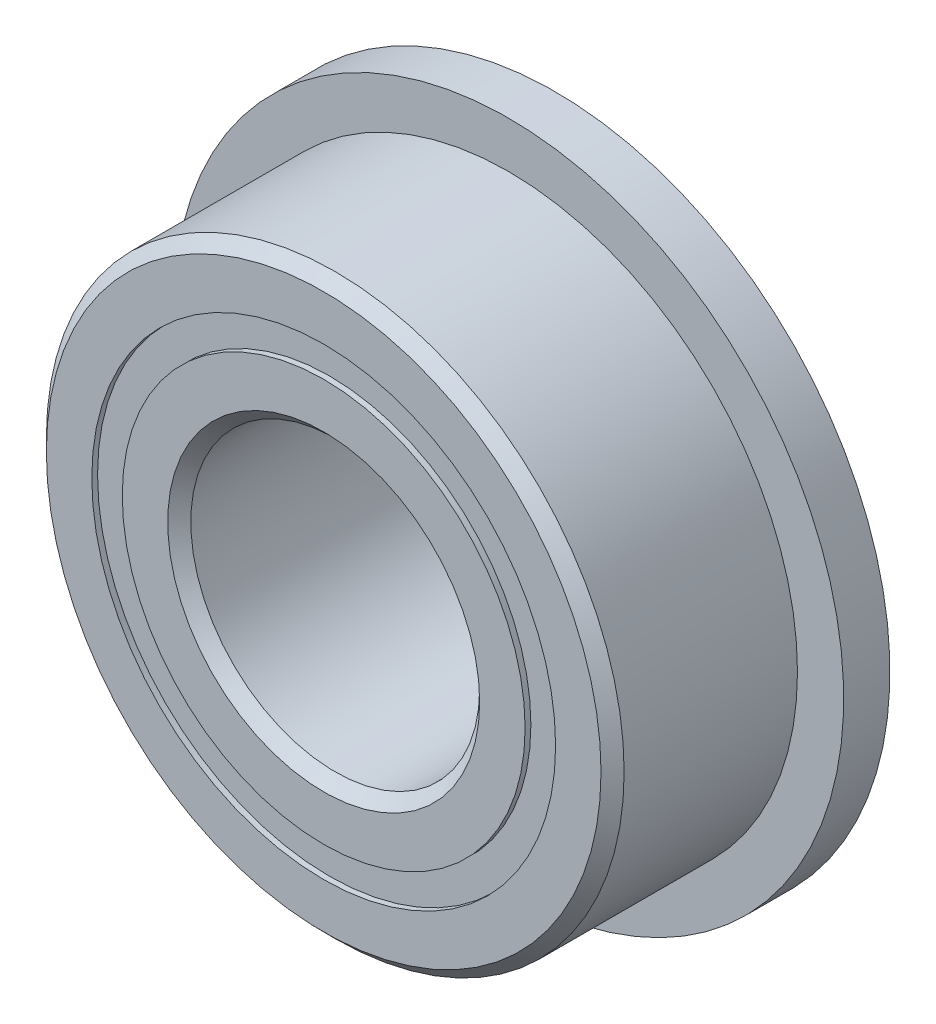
ISO-10303-21;
HEADER;
FILE_DESCRIPTION(('STEP AP214'),'2;1');
FILE_NAME('part.step','',(''),(''),'','','');
FILE_SCHEMA(('AUTOMOTIVE_DESIGN { 1 0 10303 214 1 1 1 1 }'));
ENDSEC;
DATA;
#1=APPLICATION_CONTEXT('core data for automotive mechanical design processes');
#2=APPLICATION_PROTOCOL_DEFINITION('international standard','automotive_design',2000,#1);
#3=PRODUCT_CONTEXT('',#1,'mechanical');
#4=PRODUCT('Part','Part','',(#3));
#5=PRODUCT_RELATED_PRODUCT_CATEGORY('part','',(#4));
#6=PRODUCT_DEFINITION_FORMATION('','',#4);
#7=PRODUCT_DEFINITION_CONTEXT('part definition',#1,'design');
#8=PRODUCT_DEFINITION('design','',#6,#7);
#9=PRODUCT_DEFINITION_SHAPE('','',#8);
#10=(LENGTH_UNIT() NAMED_UNIT(*) SI_UNIT(.MILLI.,.METRE.));
#11=(NAMED_UNIT(*) PLANE_ANGLE_UNIT() SI_UNIT($,.RADIAN.));
#12=(NAMED_UNIT(*) SI_UNIT($,.STERADIAN.) SOLID_ANGLE_UNIT());
#13=UNCERTAINTY_MEASURE_WITH_UNIT(LENGTH_MEASURE(1.E-05),#10,'distance_accuracy_value','');
#14=(GEOMETRIC_REPRESENTATION_CONTEXT(3) GLOBAL_UNCERTAINTY_ASSIGNED_CONTEXT((#13)) GLOBAL_UNIT_ASSIGNED_CONTEXT((#10,
#11,#12)) REPRESENTATION_CONTEXT('',''));
#15=CARTESIAN_POINT('',(0.,0.,0.));
#16=DIRECTION('',(0.,0.,1.));
#17=DIRECTION('',(1.,0.,0.));
#18=AXIS2_PLACEMENT_3D('',#15,#16,#17);
#19=CARTESIAN_POINT('',(1.87499999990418,3.24759526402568,0.));
#20=DIRECTION('',(0.866025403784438,-0.500000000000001,1.4901161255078E-08));
#21=DIRECTION('',(1.29047911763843E-08,-7.45056822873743E-09,-1.));
#22=AXIS2_PLACEMENT_3D('',#19,#20,#21);
#23=CIRCLE('',#22,0.927189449);
#24=TRIMMED_CURVE('',#23,(PARAMETER_VALUE(0.)),(PARAMETER_VALUE(3.14159262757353)),.T.,.PARAMETER.);
#25=CARTESIAN_POINT('',(1.875,3.247595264,0.));
#26=DIRECTION('',(0.,0.,1.));
#27=AXIS1_PLACEMENT('',#25,#26);
#28=SURFACE_OF_REVOLUTION('',#24,#27);
#29=CARTESIAN_POINT('',(1.875,3.247595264,-0.927189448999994));
#30=VERTEX_POINT('',#29);
#31=VERTEX_LOOP('',#30);
#32=FACE_BOUND('',#31,.T.);
#33=CARTESIAN_POINT('',(1.875,3.247595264,0.927189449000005));
#34=VERTEX_POINT('',#33);
#35=VERTEX_LOOP('',#34);
#36=FACE_BOUND('',#35,.T.);
#37=ADVANCED_FACE('P0_F15',(#32,#36),#28,.T.);
#38=CLOSED_SHELL('',(#37));
#39=MANIFOLD_SOLID_BREP('P0_B1',#38);
#40=CARTESIAN_POINT('',(0.,3.75,0.));
#41=DIRECTION('',(0.,0.,1.));
#42=DIRECTION('',(0.,-1.,0.));
#43=AXIS2_PLACEMENT_3D('',#40,#41,#42);
#44=SPHERICAL_SURFACE('',#43,0.927189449);
#45=CARTESIAN_POINT('',(0.,3.75,-0.927189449));
#46=VERTEX_POINT('',#45);
#47=VERTEX_LOOP('',#46);
#48=FACE_BOUND('',#47,.T.);
#49=CARTESIAN_POINT('',(0.,3.75,0.927189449));
#50=VERTEX_POINT('',#49);
#51=VERTEX_LOOP('',#50);
#52=FACE_BOUND('',#51,.T.);
#53=ADVANCED_FACE('P1_F15',(#48,#52),#44,.T.);
#54=CLOSED_SHELL('',(#53));
#55=MANIFOLD_SOLID_BREP('P1_B1',#54);
#56=CARTESIAN_POINT('',(-3.576322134,0.,-0.910777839));
#57=CARTESIAN_POINT('',(-3.576322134,-7.152644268,-0.910777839));
#58=CARTESIAN_POINT('',(3.576322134,-7.152644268,-0.910777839));
#59=CARTESIAN_POINT('',(3.576322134,0.,-0.910777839));
#60=CARTESIAN_POINT('',(-3.079483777,0.,-0.816034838));
#61=CARTESIAN_POINT('',(-3.079483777,-6.158967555,-0.816034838));
#62=CARTESIAN_POINT('',(3.079483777,-6.158967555,-0.816034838));
#63=CARTESIAN_POINT('',(3.079483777,0.,-0.816034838));
#64=CARTESIAN_POINT('',(-2.776947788,0.,-0.410699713));
#65=CARTESIAN_POINT('',(-2.776947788,-5.553895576,-0.410699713));
#66=CARTESIAN_POINT('',(2.776947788,-5.553895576,-0.410699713));
#67=CARTESIAN_POINT('',(2.776947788,0.,-0.410699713));
#68=CARTESIAN_POINT('',(-2.827442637,0.,0.092564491));
#69=CARTESIAN_POINT('',(-2.827442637,-5.654885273,0.0925644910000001));
#70=CARTESIAN_POINT('',(2.827442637,-5.654885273,0.0925644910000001));
#71=CARTESIAN_POINT('',(2.827442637,0.,0.092564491));
#72=(BOUNDED_SURFACE() B_SPLINE_SURFACE(3,3,((#56,#57,#58,#59),(#60,#61,#62,#63),(#64,#65,#66,
#67),(#68,#69,#70,#71)),.UNSPECIFIED.,.F.,.F.,.F.) B_SPLINE_SURFACE_WITH_KNOTS((4,4),(4,4),(0.,
1.),(0.,1.),.UNSPECIFIED.) GEOMETRIC_REPRESENTATION_ITEM() RATIONAL_B_SPLINE_SURFACE(((1.,
0.333333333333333,0.333333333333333,1.),(0.825113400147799,0.275037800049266,0.275037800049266,
0.825113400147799),(0.825113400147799,0.275037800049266,0.275037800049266,0.825113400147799),
(1.,0.333333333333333,0.333333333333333,1.))) REPRESENTATION_ITEM('') SURFACE());
#73=CARTESIAN_POINT('',(-3.576322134,0.,-0.910777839));
#74=CARTESIAN_POINT('',(-3.079483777,0.,-0.816034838));
#75=CARTESIAN_POINT('',(-2.776947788,0.,-0.410699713));
#76=CARTESIAN_POINT('',(-2.827442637,0.,0.092564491));
#77=(BOUNDED_CURVE() B_SPLINE_CURVE(3,(#73,#74,#75,#76),.UNSPECIFIED.,.F.,
.F.) B_SPLINE_CURVE_WITH_KNOTS((4,4),(0.,1.),
.UNSPECIFIED.) CURVE() GEOMETRIC_REPRESENTATION_ITEM() RATIONAL_B_SPLINE_CURVE((1.,
0.825113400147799,0.825113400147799,1.)) REPRESENTATION_ITEM(''));
#78=CARTESIAN_POINT('',(-3.4862637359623,-1.07256696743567E-09,-0.888888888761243));
#79=VERTEX_POINT('',#78);
#80=CARTESIAN_POINT('',(-2.82281055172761,0.,-9.19291736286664E-12));
#81=VERTEX_POINT('',#80);
#82=EDGE_CURVE('P2_E58',#79,#81,#77,.T.);
#83=CARTESIAN_POINT('',(0.,0.,-0.888888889));
#84=DIRECTION('',(0.,0.,1.));
#85=DIRECTION('',(1.,0.,0.));
#86=AXIS2_PLACEMENT_3D('',#83,#84,#85);
#87=CIRCLE('',#86,3.486263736);
#88=CARTESIAN_POINT('',(3.4862637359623,-3.13044270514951E-10,-0.888888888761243));
#89=VERTEX_POINT('',#88);
#90=EDGE_CURVE('P2_E63',#79,#89,#87,.T.);
#91=CARTESIAN_POINT('',(3.576322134,0.,-0.910777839));
#92=CARTESIAN_POINT('',(3.079483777,0.,-0.816034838));
#93=CARTESIAN_POINT('',(2.776947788,0.,-0.410699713));
#94=CARTESIAN_POINT('',(2.827442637,0.,0.092564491));
#95=(BOUNDED_CURVE() B_SPLINE_CURVE(3,(#91,#92,#93,#94),.UNSPECIFIED.,.F.,
.F.) B_SPLINE_CURVE_WITH_KNOTS((4,4),(0.,1.),
.UNSPECIFIED.) CURVE() GEOMETRIC_REPRESENTATION_ITEM() RATIONAL_B_SPLINE_CURVE((1.,
0.825113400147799,0.825113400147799,1.)) REPRESENTATION_ITEM(''));
#96=CARTESIAN_POINT('',(2.82281055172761,0.,-9.19292350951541E-12));
#97=VERTEX_POINT('',#96);
#98=EDGE_CURVE('P2_E50',#97,#89,#95,.F.);
#99=CARTESIAN_POINT('',(0.,0.,-1.8385876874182E-11));
#100=DIRECTION('',(0.,0.,-1.));
#101=DIRECTION('',(0.,1.,0.));
#102=AXIS2_PLACEMENT_3D('',#99,#100,#101);
#103=CIRCLE('',#102,2.82281055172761);
#104=EDGE_CURVE('P2_E71',#97,#81,#103,.T.);
#105=ORIENTED_EDGE('',*,*,#82,.F.);
#106=ORIENTED_EDGE('',*,*,#90,.T.);
#107=ORIENTED_EDGE('',*,*,#98,.F.);
#108=ORIENTED_EDGE('',*,*,#104,.T.);
#109=EDGE_LOOP('',(#105,#106,#107,#108));
#110=FACE_BOUND('',#109,.T.);
#111=ADVANCED_FACE('P2_F16',(#110),#72,.F.);
#112=CARTESIAN_POINT('',(-2.827442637,0.,-0.092564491));
#113=CARTESIAN_POINT('',(-2.827442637,-5.654885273,-0.0925644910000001));
#114=CARTESIAN_POINT('',(2.827442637,-5.654885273,-0.0925644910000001));
#115=CARTESIAN_POINT('',(2.827442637,0.,-0.092564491));
#116=CARTESIAN_POINT('',(-2.776947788,0.,0.410699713));
#117=CARTESIAN_POINT('',(-2.776947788,-5.553895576,0.410699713));
#118=CARTESIAN_POINT('',(2.776947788,-5.553895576,0.410699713));
#119=CARTESIAN_POINT('',(2.776947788,0.,0.410699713));
#120=CARTESIAN_POINT('',(-3.079483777,0.,0.816034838));
#121=CARTESIAN_POINT('',(-3.079483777,-6.158967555,0.816034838));
#122=CARTESIAN_POINT('',(3.079483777,-6.158967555,0.816034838));
#123=CARTESIAN_POINT('',(3.079483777,0.,0.816034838));
#124=CARTESIAN_POINT('',(-3.576322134,0.,0.910777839));
#125=CARTESIAN_POINT('',(-3.576322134,-7.152644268,0.910777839));
#126=CARTESIAN_POINT('',(3.576322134,-7.152644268,0.910777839));
#127=CARTESIAN_POINT('',(3.576322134,0.,0.910777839));
#128=(BOUNDED_SURFACE() B_SPLINE_SURFACE(3,3,((#112,#113,#114,#115),(#116,#117,#118,#119),(#120,
#121,#122,#123),(#124,#125,#126,#127)),.UNSPECIFIED.,.F.,.F.,
.F.) B_SPLINE_SURFACE_WITH_KNOTS((4,4),(4,4),(0.,1.),(0.,1.),
.UNSPECIFIED.) GEOMETRIC_REPRESENTATION_ITEM() RATIONAL_B_SPLINE_SURFACE(((1.,0.333333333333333,
0.333333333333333,1.),(0.825113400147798,0.275037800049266,0.275037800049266,0.825113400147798),
(0.825113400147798,0.275037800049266,0.275037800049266,0.825113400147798),(1.,0.333333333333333,
0.333333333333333,1.))) REPRESENTATION_ITEM('') SURFACE());
#129=CARTESIAN_POINT('',(2.827442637,0.,-0.092564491));
#130=CARTESIAN_POINT('',(2.776947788,0.,0.410699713));
#131=CARTESIAN_POINT('',(3.079483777,0.,0.816034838));
#132=CARTESIAN_POINT('',(3.576322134,0.,0.910777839));
#133=(BOUNDED_CURVE() B_SPLINE_CURVE(3,(#129,#130,#131,#132),.UNSPECIFIED.,.F.,
.F.) B_SPLINE_CURVE_WITH_KNOTS((4,4),(0.,1.),
.UNSPECIFIED.) CURVE() GEOMETRIC_REPRESENTATION_ITEM() RATIONAL_B_SPLINE_CURVE((1.,
0.825113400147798,0.825113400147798,1.)) REPRESENTATION_ITEM(''));
#134=CARTESIAN_POINT('',(3.48626373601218,-3.13044270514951E-10,0.888888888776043));
#135=VERTEX_POINT('',#134);
#136=EDGE_CURVE('P2_E76',#135,#97,#133,.F.);
#137=CARTESIAN_POINT('',(0.,0.,0.888888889));
#138=DIRECTION('',(0.,0.,1.));
#139=DIRECTION('',(1.,0.,0.));
#140=AXIS2_PLACEMENT_3D('',#137,#138,#139);
#141=CIRCLE('',#140,3.486263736);
#142=CARTESIAN_POINT('',(-3.4862637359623,-1.07256696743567E-09,0.888888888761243));
#143=VERTEX_POINT('',#142);
#144=EDGE_CURVE('P2_E69',#135,#143,#141,.F.);
#145=CARTESIAN_POINT('',(-2.827442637,0.,-0.092564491));
#146=CARTESIAN_POINT('',(-2.776947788,0.,0.410699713));
#147=CARTESIAN_POINT('',(-3.079483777,0.,0.816034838));
#148=CARTESIAN_POINT('',(-3.576322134,0.,0.910777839));
#149=(BOUNDED_CURVE() B_SPLINE_CURVE(3,(#145,#146,#147,#148),.UNSPECIFIED.,.F.,
.F.) B_SPLINE_CURVE_WITH_KNOTS((4,4),(0.,1.),
.UNSPECIFIED.) CURVE() GEOMETRIC_REPRESENTATION_ITEM() RATIONAL_B_SPLINE_CURVE((1.,
0.825113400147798,0.825113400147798,1.)) REPRESENTATION_ITEM(''));
#150=EDGE_CURVE('P2_E35',#81,#143,#149,.T.);
#151=ORIENTED_EDGE('',*,*,#104,.F.);
#152=ORIENTED_EDGE('',*,*,#136,.F.);
#153=ORIENTED_EDGE('',*,*,#144,.T.);
#154=ORIENTED_EDGE('',*,*,#150,.F.);
#155=EDGE_LOOP('',(#151,#152,#153,#154));
#156=FACE_BOUND('',#155,.T.);
#157=ADVANCED_FACE('P2_F121',(#156),#128,.F.);
#158=CARTESIAN_POINT('',(0.,0.,-1.8));
#159=DIRECTION('',(0.,0.,1.));
#160=DIRECTION('',(1.,0.,0.));
#161=AXIS2_PLACEMENT_3D('',#158,#159,#160);
#162=CYLINDRICAL_SURFACE('',#161,2.5);
#163=CARTESIAN_POINT('',(0.,0.,-1.79999999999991));
#164=DIRECTION('',(0.,0.,-1.));
#165=DIRECTION('',(-1.,0.,0.));
#166=AXIS2_PLACEMENT_3D('',#163,#164,#165);
#167=CIRCLE('',#166,2.5);
#168=CARTESIAN_POINT('',(-2.5,0.,-1.8));
#169=VERTEX_POINT('',#168);
#170=EDGE_CURVE('P2_E66',#169,#169,#167,.F.);
#171=ORIENTED_EDGE('',*,*,#170,.F.);
#172=EDGE_LOOP('',(#171));
#173=FACE_BOUND('',#172,.T.);
#174=CARTESIAN_POINT('',(0.,0.,1.80000000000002));
#175=DIRECTION('',(0.,0.,1.));
#176=DIRECTION('',(1.,0.,0.));
#177=AXIS2_PLACEMENT_3D('',#174,#175,#176);
#178=CIRCLE('',#177,2.5);
#179=CARTESIAN_POINT('',(2.5,0.,1.8));
#180=VERTEX_POINT('',#179);
#181=EDGE_CURVE('P2_E96',#180,#180,#178,.F.);
#182=ORIENTED_EDGE('',*,*,#181,.F.);
#183=EDGE_LOOP('',(#182));
#184=FACE_BOUND('',#183,.T.);
#185=ADVANCED_FACE('P2_F167',(#173,#184),#162,.F.);
#186=CARTESIAN_POINT('',(0.,0.,-1.8));
#187=DIRECTION('',(0.,0.,-1.));
#188=DIRECTION('',(-1.,0.,0.));
#189=AXIS2_PLACEMENT_3D('',#186,#187,#188);
#190=CONICAL_SURFACE('',#189,2.5,0.785398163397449);
#191=CARTESIAN_POINT('',(0.,0.,-1.99999999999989));
#192=DIRECTION('',(0.,0.,-1.));
#193=DIRECTION('',(-1.,0.,0.));
#194=AXIS2_PLACEMENT_3D('',#191,#192,#193);
#195=CIRCLE('',#194,2.69999999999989);
#196=CARTESIAN_POINT('',(-2.69999999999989,0.,-1.99999999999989));
#197=VERTEX_POINT('',#196);
#198=EDGE_CURVE('P2_E20',#197,#197,#195,.T.);
#199=ORIENTED_EDGE('',*,*,#198,.T.);
#200=EDGE_LOOP('',(#199));
#201=FACE_BOUND('',#200,.T.);
#202=ORIENTED_EDGE('',*,*,#170,.T.);
#203=EDGE_LOOP('',(#202));
#204=FACE_BOUND('',#203,.T.);
#205=ADVANCED_FACE('P2_F164',(#201,#204),#190,.F.);
#206=CARTESIAN_POINT('',(0.,0.,1.8));
#207=DIRECTION('',(0.,0.,1.));
#208=DIRECTION('',(1.,0.,0.));
#209=AXIS2_PLACEMENT_3D('',#206,#207,#208);
#210=CONICAL_SURFACE('',#209,2.5,0.785398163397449);
#211=ORIENTED_EDGE('',*,*,#181,.T.);
#212=EDGE_LOOP('',(#211));
#213=FACE_BOUND('',#212,.T.);
#214=CARTESIAN_POINT('',(0.,0.,2.));
#215=DIRECTION('',(0.,0.,1.));
#216=DIRECTION('',(1.,0.,0.));
#217=AXIS2_PLACEMENT_3D('',#214,#215,#216);
#218=CIRCLE('',#217,2.7);
#219=CARTESIAN_POINT('',(2.7,0.,2.));
#220=VERTEX_POINT('',#219);
#221=EDGE_CURVE('P2_E91',#220,#220,#218,.T.);
#222=ORIENTED_EDGE('',*,*,#221,.T.);
#223=EDGE_LOOP('',(#222));
#224=FACE_BOUND('',#223,.T.);
#225=ADVANCED_FACE('P2_F139',(#213,#224),#210,.F.);
#226=CARTESIAN_POINT('',(-3.528098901,-3.528098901,-2.));
#227=DIRECTION('',(0.,0.,1.));
#228=DIRECTION('',(1.,0.,0.));
#229=AXIS2_PLACEMENT_3D('',#226,#227,#228);
#230=PLANE('',#229);
#231=ORIENTED_EDGE('',*,*,#198,.F.);
#232=EDGE_LOOP('',(#231));
#233=FACE_BOUND('',#232,.T.);
#234=CARTESIAN_POINT('',(0.,0.,-2.));
#235=DIRECTION('',(0.,0.,1.));
#236=DIRECTION('',(1.,0.,0.));
#237=AXIS2_PLACEMENT_3D('',#234,#235,#236);
#238=CIRCLE('',#237,3.486263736);
#239=CARTESIAN_POINT('',(3.486263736,0.,-2.));
#240=VERTEX_POINT('',#239);
#241=EDGE_CURVE('P2_E89',#240,#240,#238,.F.);
#242=ORIENTED_EDGE('',*,*,#241,.T.);
#243=EDGE_LOOP('',(#242));
#244=FACE_BOUND('',#243,.T.);
#245=ADVANCED_FACE('P2_F130',(#233,#244),#230,.F.);
#246=CARTESIAN_POINT('',(3.528098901,-3.528098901,2.));
#247=DIRECTION('',(0.,0.,-1.));
#248=DIRECTION('',(-1.,0.,0.));
#249=AXIS2_PLACEMENT_3D('',#246,#247,#248);
#250=PLANE('',#249);
#251=ORIENTED_EDGE('',*,*,#221,.F.);
#252=EDGE_LOOP('',(#251));
#253=FACE_BOUND('',#252,.T.);
#254=CARTESIAN_POINT('',(0.,0.,2.));
#255=DIRECTION('',(0.,0.,1.));
#256=DIRECTION('',(0.,-1.,0.));
#257=AXIS2_PLACEMENT_3D('',#254,#255,#256);
#258=CIRCLE('',#257,3.486263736);
#259=CARTESIAN_POINT('',(0.,-3.486263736,2.));
#260=VERTEX_POINT('',#259);
#261=EDGE_CURVE('P2_E64',#260,#260,#258,.T.);
#262=ORIENTED_EDGE('',*,*,#261,.T.);
#263=EDGE_LOOP('',(#262));
#264=FACE_BOUND('',#263,.T.);
#265=ADVANCED_FACE('P2_F18',(#253,#264),#250,.F.);
#266=CARTESIAN_POINT('',(0.,0.,-2.));
#267=DIRECTION('',(0.,0.,1.));
#268=DIRECTION('',(1.,0.,0.));
#269=AXIS2_PLACEMENT_3D('',#266,#267,#268);
#270=CYLINDRICAL_SURFACE('',#269,3.486263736);
#271=ORIENTED_EDGE('',*,*,#241,.F.);
#272=EDGE_LOOP('',(#271));
#273=FACE_BOUND('',#272,.T.);
#274=CARTESIAN_POINT('',(0.,0.,-0.888888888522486));
#275=DIRECTION('',(0.,0.,-1.));
#276=DIRECTION('',(0.,1.,0.));
#277=AXIS2_PLACEMENT_3D('',#274,#275,#276);
#278=CIRCLE('',#277,3.48626373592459);
#279=EDGE_CURVE('P2_E53',#79,#89,#278,.T.);
#280=ORIENTED_EDGE('',*,*,#279,.T.);
#281=ORIENTED_EDGE('',*,*,#90,.F.);
#282=EDGE_LOOP('',(#280,#281));
#283=FACE_BOUND('',#282,.T.);
#284=ADVANCED_FACE('P2_F62',(#273,#283),#270,.T.);
#285=CARTESIAN_POINT('',(0.,0.,0.888888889));
#286=DIRECTION('',(0.,0.,1.));
#287=DIRECTION('',(0.,-1.,0.));
#288=AXIS2_PLACEMENT_3D('',#285,#286,#287);
#289=CYLINDRICAL_SURFACE('',#288,3.486263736);
#290=ORIENTED_EDGE('',*,*,#144,.F.);
#291=CARTESIAN_POINT('',(0.,0.,0.888888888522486));
#292=DIRECTION('',(0.,0.,1.));
#293=DIRECTION('',(0.,-1.,0.));
#294=AXIS2_PLACEMENT_3D('',#291,#292,#293);
#295=CIRCLE('',#294,3.48626373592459);
#296=EDGE_CURVE('P2_E26',#135,#143,#295,.T.);
#297=ORIENTED_EDGE('',*,*,#296,.T.);
#298=EDGE_LOOP('',(#290,#297));
#299=FACE_BOUND('',#298,.T.);
#300=ORIENTED_EDGE('',*,*,#261,.F.);
#301=EDGE_LOOP('',(#300));
#302=FACE_BOUND('',#301,.T.);
#303=ADVANCED_FACE('P2_F123',(#299,#302),#289,.T.);
#304=CARTESIAN_POINT('',(3.576322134,0.,-0.910777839));
#305=CARTESIAN_POINT('',(3.576322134,7.152644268,-0.910777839));
#306=CARTESIAN_POINT('',(-3.576322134,7.152644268,-0.910777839));
#307=CARTESIAN_POINT('',(-3.576322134,0.,-0.910777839));
#308=CARTESIAN_POINT('',(3.079483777,0.,-0.816034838));
#309=CARTESIAN_POINT('',(3.079483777,6.158967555,-0.816034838));
#310=CARTESIAN_POINT('',(-3.079483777,6.158967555,-0.816034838));
#311=CARTESIAN_POINT('',(-3.079483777,0.,-0.816034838));
#312=CARTESIAN_POINT('',(2.776947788,0.,-0.410699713));
#313=CARTESIAN_POINT('',(2.776947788,5.553895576,-0.410699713));
#314=CARTESIAN_POINT('',(-2.776947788,5.553895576,-0.410699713));
#315=CARTESIAN_POINT('',(-2.776947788,0.,-0.410699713));
#316=CARTESIAN_POINT('',(2.827442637,0.,0.092564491));
#317=CARTESIAN_POINT('',(2.827442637,5.654885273,0.0925644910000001));
#318=CARTESIAN_POINT('',(-2.827442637,5.654885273,0.0925644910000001));
#319=CARTESIAN_POINT('',(-2.827442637,0.,0.092564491));
#320=(BOUNDED_SURFACE() B_SPLINE_SURFACE(3,3,((#304,#305,#306,#307),(#308,#309,#310,#311),(#312,
#313,#314,#315),(#316,#317,#318,#319)),.UNSPECIFIED.,.F.,.F.,
.F.) B_SPLINE_SURFACE_WITH_KNOTS((4,4),(4,4),(0.,1.),(0.,1.),
.UNSPECIFIED.) GEOMETRIC_REPRESENTATION_ITEM() RATIONAL_B_SPLINE_SURFACE(((1.,0.333333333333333,
0.333333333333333,1.),(0.825113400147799,0.275037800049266,0.275037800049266,0.825113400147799),
(0.825113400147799,0.275037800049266,0.275037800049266,0.825113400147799),(1.,0.333333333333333,
0.333333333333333,1.))) REPRESENTATION_ITEM('') SURFACE());
#321=CARTESIAN_POINT('',(0.,0.,-1.8385876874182E-11));
#322=DIRECTION('',(0.,0.,-1.));
#323=DIRECTION('',(0.,1.,0.));
#324=AXIS2_PLACEMENT_3D('',#321,#322,#323);
#325=CIRCLE('',#324,2.82281055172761);
#326=EDGE_CURVE('P2_E11',#81,#97,#325,.T.);
#327=ORIENTED_EDGE('',*,*,#98,.T.);
#328=ORIENTED_EDGE('',*,*,#279,.F.);
#329=ORIENTED_EDGE('',*,*,#82,.T.);
#330=ORIENTED_EDGE('',*,*,#326,.T.);
#331=EDGE_LOOP('',(#327,#328,#329,#330));
#332=FACE_BOUND('',#331,.T.);
#333=ADVANCED_FACE('P2_F52',(#332),#320,.F.);
#334=CARTESIAN_POINT('',(2.827442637,0.,-0.092564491));
#335=CARTESIAN_POINT('',(2.827442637,5.654885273,-0.0925644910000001));
#336=CARTESIAN_POINT('',(-2.827442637,5.654885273,-0.0925644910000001));
#337=CARTESIAN_POINT('',(-2.827442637,0.,-0.092564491));
#338=CARTESIAN_POINT('',(2.776947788,0.,0.410699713));
#339=CARTESIAN_POINT('',(2.776947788,5.553895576,0.410699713));
#340=CARTESIAN_POINT('',(-2.776947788,5.553895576,0.410699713));
#341=CARTESIAN_POINT('',(-2.776947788,0.,0.410699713));
#342=CARTESIAN_POINT('',(3.079483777,0.,0.816034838));
#343=CARTESIAN_POINT('',(3.079483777,6.158967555,0.816034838));
#344=CARTESIAN_POINT('',(-3.079483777,6.158967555,0.816034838));
#345=CARTESIAN_POINT('',(-3.079483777,0.,0.816034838));
#346=CARTESIAN_POINT('',(3.576322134,0.,0.910777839));
#347=CARTESIAN_POINT('',(3.576322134,7.152644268,0.910777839));
#348=CARTESIAN_POINT('',(-3.576322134,7.152644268,0.910777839));
#349=CARTESIAN_POINT('',(-3.576322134,0.,0.910777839));
#350=(BOUNDED_SURFACE() B_SPLINE_SURFACE(3,3,((#334,#335,#336,#337),(#338,#339,#340,#341),(#342,
#343,#344,#345),(#346,#347,#348,#349)),.UNSPECIFIED.,.F.,.F.,
.F.) B_SPLINE_SURFACE_WITH_KNOTS((4,4),(4,4),(0.,1.),(0.,1.),
.UNSPECIFIED.) GEOMETRIC_REPRESENTATION_ITEM() RATIONAL_B_SPLINE_SURFACE(((1.,0.333333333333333,
0.333333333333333,1.),(0.825113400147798,0.275037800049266,0.275037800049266,0.825113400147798),
(0.825113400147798,0.275037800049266,0.275037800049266,0.825113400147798),(1.,0.333333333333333,
0.333333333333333,1.))) REPRESENTATION_ITEM('') SURFACE());
#351=ORIENTED_EDGE('',*,*,#326,.F.);
#352=ORIENTED_EDGE('',*,*,#150,.T.);
#353=ORIENTED_EDGE('',*,*,#296,.F.);
#354=ORIENTED_EDGE('',*,*,#136,.T.);
#355=EDGE_LOOP('',(#351,#352,#353,#354));
#356=FACE_BOUND('',#355,.T.);
#357=ADVANCED_FACE('P2_F118',(#356),#350,.F.);
#358=CLOSED_SHELL('',(#111,#157,#185,#205,#225,#245,#265,#284,#303,#333,#357));
#359=MANIFOLD_SOLID_BREP('P2_B1',#358);
#360=CARTESIAN_POINT('',(0.,0.,0.888888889));
#361=DIRECTION('',(0.,0.,1.));
#362=DIRECTION('',(0.,-1.,0.));
#363=AXIS2_PLACEMENT_3D('',#360,#361,#362);
#364=CYLINDRICAL_SURFACE('',#363,4.013736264);
#365=CARTESIAN_POINT('',(0.,0.,0.888888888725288));
#366=DIRECTION('',(0.,0.,-1.));
#367=DIRECTION('',(0.,1.,0.));
#368=AXIS2_PLACEMENT_3D('',#365,#366,#367);
#369=CIRCLE('',#368,4.01373626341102);
#370=CARTESIAN_POINT('',(4.01373626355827,0.,0.888888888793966));
#371=VERTEX_POINT('',#370);
#372=CARTESIAN_POINT('',(-4.01373626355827,-4.11615534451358E-10,0.888888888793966));
#373=VERTEX_POINT('',#372);
#374=EDGE_CURVE('P3_E44',#371,#373,#369,.T.);
#375=ORIENTED_EDGE('',*,*,#374,.T.);
#376=CARTESIAN_POINT('',(0.,0.,0.888888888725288));
#377=DIRECTION('',(0.,0.,-1.));
#378=DIRECTION('',(0.,1.,0.));
#379=AXIS2_PLACEMENT_3D('',#376,#377,#378);
#380=CIRCLE('',#379,4.01373626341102);
#381=EDGE_CURVE('P3_E43',#373,#371,#380,.T.);
#382=ORIENTED_EDGE('',*,*,#381,.T.);
#383=EDGE_LOOP('',(#375,#382));
#384=FACE_BOUND('',#383,.T.);
#385=CARTESIAN_POINT('',(0.,0.,2.));
#386=DIRECTION('',(0.,0.,1.));
#387=DIRECTION('',(0.,-1.,0.));
#388=AXIS2_PLACEMENT_3D('',#385,#386,#387);
#389=CIRCLE('',#388,4.013736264);
#390=CARTESIAN_POINT('',(0.,-4.013736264,2.));
#391=VERTEX_POINT('',#390);
#392=EDGE_CURVE('P3_E20',#391,#391,#389,.T.);
#393=ORIENTED_EDGE('',*,*,#392,.T.);
#394=EDGE_LOOP('',(#393));
#395=FACE_BOUND('',#394,.T.);
#396=ADVANCED_FACE('P3_F16',(#384,#395),#364,.F.);
#397=CARTESIAN_POINT('',(4.8576,-4.8576,2.));
#398=DIRECTION('',(0.,0.,-1.));
#399=DIRECTION('',(-1.,0.,0.));
#400=AXIS2_PLACEMENT_3D('',#397,#398,#399);
#401=PLANE('',#400);
#402=ORIENTED_EDGE('',*,*,#392,.F.);
#403=EDGE_LOOP('',(#402));
#404=FACE_BOUND('',#403,.T.);
#405=CARTESIAN_POINT('',(0.,0.,2.));
#406=DIRECTION('',(0.,0.,-1.));
#407=DIRECTION('',(-1.,0.,0.));
#408=AXIS2_PLACEMENT_3D('',#405,#406,#407);
#409=CIRCLE('',#408,4.8);
#410=CARTESIAN_POINT('',(-4.8,0.,2.));
#411=VERTEX_POINT('',#410);
#412=EDGE_CURVE('P3_E55',#411,#411,#409,.F.);
#413=ORIENTED_EDGE('',*,*,#412,.T.);
#414=EDGE_LOOP('',(#413));
#415=FACE_BOUND('',#414,.T.);
#416=ADVANCED_FACE('P3_F167',(#404,#415),#401,.F.);
#417=CARTESIAN_POINT('',(-3.923677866,0.,0.910777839));
#418=CARTESIAN_POINT('',(-3.923677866,-7.847355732,0.910777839));
#419=CARTESIAN_POINT('',(3.923677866,-7.847355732,0.910777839));
#420=CARTESIAN_POINT('',(3.923677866,0.,0.910777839));
#421=CARTESIAN_POINT('',(-5.225344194,0.,0.662560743));
#422=CARTESIAN_POINT('',(-5.225344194,-10.450688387,0.662560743));
#423=CARTESIAN_POINT('',(5.225344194,-10.450688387,0.662560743));
#424=CARTESIAN_POINT('',(5.225344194,0.,0.662560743));
#425=CARTESIAN_POINT('',(-5.225344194,0.,-0.662560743));
#426=CARTESIAN_POINT('',(-5.225344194,-10.450688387,-0.662560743));
#427=CARTESIAN_POINT('',(5.225344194,-10.450688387,-0.662560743));
#428=CARTESIAN_POINT('',(5.225344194,0.,-0.662560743));
#429=CARTESIAN_POINT('',(-3.923677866,0.,-0.910777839));
#430=CARTESIAN_POINT('',(-3.923677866,-7.847355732,-0.910777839));
#431=CARTESIAN_POINT('',(3.923677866,-7.847355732,-0.910777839));
#432=CARTESIAN_POINT('',(3.923677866,0.,-0.910777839));
#433=(BOUNDED_SURFACE() B_SPLINE_SURFACE(3,3,((#417,#418,#419,#420),(#421,#422,#423,#424),(#425,
#426,#427,#428),(#429,#430,#431,#432)),.UNSPECIFIED.,.F.,.F.,
.F.) B_SPLINE_SURFACE_WITH_KNOTS((4,4),(4,4),(0.,1.),(0.,1.),
.UNSPECIFIED.) GEOMETRIC_REPRESENTATION_ITEM() RATIONAL_B_SPLINE_SURFACE(((1.,0.333333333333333,
0.333333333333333,1.),(0.458210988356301,0.152736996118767,0.152736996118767,0.458210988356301),
(0.458210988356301,0.152736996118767,0.152736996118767,0.458210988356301),(1.,0.333333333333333,
0.333333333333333,1.))) REPRESENTATION_ITEM('') SURFACE());
#434=CARTESIAN_POINT('',(-3.923677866,0.,0.910777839));
#435=CARTESIAN_POINT('',(-5.225344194,0.,0.662560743));
#436=CARTESIAN_POINT('',(-5.225344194,0.,-0.662560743));
#437=CARTESIAN_POINT('',(-3.923677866,0.,-0.910777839));
#438=(BOUNDED_CURVE() B_SPLINE_CURVE(3,(#434,#435,#436,#437),.UNSPECIFIED.,.F.,
.F.) B_SPLINE_CURVE_WITH_KNOTS((4,4),(0.,1.),
.UNSPECIFIED.) CURVE() GEOMETRIC_REPRESENTATION_ITEM() RATIONAL_B_SPLINE_CURVE((1.,
0.458210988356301,0.458210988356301,1.)) REPRESENTATION_ITEM(''));
#439=CARTESIAN_POINT('',(-4.01373626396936,-1.0290388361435E-09,-0.888888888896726));
#440=VERTEX_POINT('',#439);
#441=EDGE_CURVE('P3_E49',#440,#373,#438,.F.);
#442=CARTESIAN_POINT('',(3.923677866,0.,0.910777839));
#443=CARTESIAN_POINT('',(5.225344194,0.,0.662560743));
#444=CARTESIAN_POINT('',(5.225344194,0.,-0.662560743));
#445=CARTESIAN_POINT('',(3.923677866,0.,-0.910777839));
#446=(BOUNDED_CURVE() B_SPLINE_CURVE(3,(#442,#443,#444,#445),.UNSPECIFIED.,.F.,
.F.) B_SPLINE_CURVE_WITH_KNOTS((4,4),(0.,1.),
.UNSPECIFIED.) CURVE() GEOMETRIC_REPRESENTATION_ITEM() RATIONAL_B_SPLINE_CURVE((1.,
0.458210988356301,0.458210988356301,1.)) REPRESENTATION_ITEM(''));
#447=CARTESIAN_POINT('',(4.01373626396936,0.,-0.888888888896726));
#448=VERTEX_POINT('',#447);
#449=EDGE_CURVE('P3_E35',#371,#448,#446,.T.);
#450=CARTESIAN_POINT('',(0.,0.,-0.888888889));
#451=DIRECTION('',(0.,0.,1.));
#452=DIRECTION('',(1.,0.,0.));
#453=AXIS2_PLACEMENT_3D('',#450,#451,#452);
#454=CIRCLE('',#453,4.013736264);
#455=EDGE_CURVE('P3_E51',#440,#448,#454,.T.);
#456=ORIENTED_EDGE('',*,*,#441,.T.);
#457=ORIENTED_EDGE('',*,*,#374,.F.);
#458=ORIENTED_EDGE('',*,*,#449,.T.);
#459=ORIENTED_EDGE('',*,*,#455,.F.);
#460=EDGE_LOOP('',(#456,#457,#458,#459));
#461=FACE_BOUND('',#460,.T.);
#462=ADVANCED_FACE('P3_F50',(#461),#433,.F.);
#463=CARTESIAN_POINT('',(3.923677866,0.,0.910777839));
#464=CARTESIAN_POINT('',(3.923677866,7.847355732,0.910777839));
#465=CARTESIAN_POINT('',(-3.923677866,7.847355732,0.910777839));
#466=CARTESIAN_POINT('',(-3.923677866,0.,0.910777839));
#467=CARTESIAN_POINT('',(5.225344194,0.,0.662560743));
#468=CARTESIAN_POINT('',(5.225344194,10.450688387,0.662560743));
#469=CARTESIAN_POINT('',(-5.225344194,10.450688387,0.662560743));
#470=CARTESIAN_POINT('',(-5.225344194,0.,0.662560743));
#471=CARTESIAN_POINT('',(5.225344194,0.,-0.662560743));
#472=CARTESIAN_POINT('',(5.225344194,10.450688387,-0.662560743));
#473=CARTESIAN_POINT('',(-5.225344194,10.450688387,-0.662560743));
#474=CARTESIAN_POINT('',(-5.225344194,0.,-0.662560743));
#475=CARTESIAN_POINT('',(3.923677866,0.,-0.910777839));
#476=CARTESIAN_POINT('',(3.923677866,7.847355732,-0.910777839));
#477=CARTESIAN_POINT('',(-3.923677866,7.847355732,-0.910777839));
#478=CARTESIAN_POINT('',(-3.923677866,0.,-0.910777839));
#479=(BOUNDED_SURFACE() B_SPLINE_SURFACE(3,3,((#463,#464,#465,#466),(#467,#468,#469,#470),(#471,
#472,#473,#474),(#475,#476,#477,#478)),.UNSPECIFIED.,.F.,.F.,
.F.) B_SPLINE_SURFACE_WITH_KNOTS((4,4),(4,4),(0.,1.),(0.,1.),
.UNSPECIFIED.) GEOMETRIC_REPRESENTATION_ITEM() RATIONAL_B_SPLINE_SURFACE(((1.,0.333333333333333,
0.333333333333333,1.),(0.458210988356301,0.152736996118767,0.152736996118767,0.458210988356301),
(0.458210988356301,0.152736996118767,0.152736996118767,0.458210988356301),(1.,0.333333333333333,
0.333333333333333,1.))) REPRESENTATION_ITEM('') SURFACE());
#480=CARTESIAN_POINT('',(0.,0.,-0.888888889));
#481=DIRECTION('',(0.,0.,1.));
#482=DIRECTION('',(1.,0.,0.));
#483=AXIS2_PLACEMENT_3D('',#480,#481,#482);
#484=CIRCLE('',#483,4.013736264);
#485=EDGE_CURVE('P3_E72',#448,#440,#484,.T.);
#486=ORIENTED_EDGE('',*,*,#485,.F.);
#487=ORIENTED_EDGE('',*,*,#449,.F.);
#488=ORIENTED_EDGE('',*,*,#381,.F.);
#489=ORIENTED_EDGE('',*,*,#441,.F.);
#490=EDGE_LOOP('',(#486,#487,#488,#489));
#491=FACE_BOUND('',#490,.T.);
#492=ADVANCED_FACE('P3_F57',(#491),#479,.F.);
#493=CARTESIAN_POINT('',(0.,0.,2.));
#494=DIRECTION('',(0.,0.,-1.));
#495=DIRECTION('',(-1.,0.,0.));
#496=AXIS2_PLACEMENT_3D('',#493,#494,#495);
#497=CONICAL_SURFACE('',#496,4.8,0.78539816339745);
#498=ORIENTED_EDGE('',*,*,#412,.F.);
#499=EDGE_LOOP('',(#498));
#500=FACE_BOUND('',#499,.T.);
#501=CARTESIAN_POINT('',(0.,0.,1.8));
#502=DIRECTION('',(0.,0.,1.));
#503=DIRECTION('',(1.,0.,0.));
#504=AXIS2_PLACEMENT_3D('',#501,#502,#503);
#505=CIRCLE('',#504,5.);
#506=CARTESIAN_POINT('',(5.,0.,1.8));
#507=VERTEX_POINT('',#506);
#508=EDGE_CURVE('P3_E68',#507,#507,#505,.T.);
#509=ORIENTED_EDGE('',*,*,#508,.T.);
#510=EDGE_LOOP('',(#509));
#511=FACE_BOUND('',#510,.T.);
#512=ADVANCED_FACE('P3_F90',(#500,#511),#497,.T.);
#513=CARTESIAN_POINT('',(0.,0.,-2.));
#514=DIRECTION('',(0.,0.,1.));
#515=DIRECTION('',(1.,0.,0.));
#516=AXIS2_PLACEMENT_3D('',#513,#514,#515);
#517=CYLINDRICAL_SURFACE('',#516,4.013736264);
#518=CARTESIAN_POINT('',(0.,0.,-2.));
#519=DIRECTION('',(0.,0.,1.));
#520=DIRECTION('',(1.,0.,0.));
#521=AXIS2_PLACEMENT_3D('',#518,#519,#520);
#522=CIRCLE('',#521,4.013736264);
#523=CARTESIAN_POINT('',(4.013736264,0.,-2.));
#524=VERTEX_POINT('',#523);
#525=EDGE_CURVE('P3_E66',#524,#524,#522,.F.);
#526=ORIENTED_EDGE('',*,*,#525,.T.);
#527=EDGE_LOOP('',(#526));
#528=FACE_BOUND('',#527,.T.);
#529=ORIENTED_EDGE('',*,*,#485,.T.);
#530=ORIENTED_EDGE('',*,*,#455,.T.);
#531=EDGE_LOOP('',(#529,#530));
#532=FACE_BOUND('',#531,.T.);
#533=ADVANCED_FACE('P3_F95',(#528,#532),#517,.F.);
#534=CARTESIAN_POINT('',(0.,0.,-1.2));
#535=DIRECTION('',(0.,0.,1.));
#536=DIRECTION('',(1.,0.,0.));
#537=AXIS2_PLACEMENT_3D('',#534,#535,#536);
#538=CYLINDRICAL_SURFACE('',#537,5.);
#539=CARTESIAN_POINT('',(0.,0.,-1.2));
#540=DIRECTION('',(0.,0.,1.));
#541=DIRECTION('',(1.,0.,0.));
#542=AXIS2_PLACEMENT_3D('',#539,#540,#541);
#543=CIRCLE('',#542,5.);
#544=CARTESIAN_POINT('',(5.,0.,-1.2));
#545=VERTEX_POINT('',#544);
#546=EDGE_CURVE('P3_E63',#545,#545,#543,.F.);
#547=ORIENTED_EDGE('',*,*,#546,.F.);
#548=EDGE_LOOP('',(#547));
#549=FACE_BOUND('',#548,.T.);
#550=ORIENTED_EDGE('',*,*,#508,.F.);
#551=EDGE_LOOP('',(#550));
#552=FACE_BOUND('',#551,.T.);
#553=ADVANCED_FACE('P3_F92',(#549,#552),#538,.T.);
#554=CARTESIAN_POINT('',(-5.8696,-5.8696,-2.));
#555=DIRECTION('',(0.,0.,1.));
#556=DIRECTION('',(1.,0.,0.));
#557=AXIS2_PLACEMENT_3D('',#554,#555,#556);
#558=PLANE('',#557);
#559=ORIENTED_EDGE('',*,*,#525,.F.);
#560=EDGE_LOOP('',(#559));
#561=FACE_BOUND('',#560,.T.);
#562=CARTESIAN_POINT('',(0.,0.,-2.));
#563=DIRECTION('',(0.,0.,-1.));
#564=DIRECTION('',(-1.,0.,0.));
#565=AXIS2_PLACEMENT_3D('',#562,#563,#564);
#566=CIRCLE('',#565,5.8);
#567=CARTESIAN_POINT('',(-5.8,0.,-2.));
#568=VERTEX_POINT('',#567);
#569=EDGE_CURVE('P3_E26',#568,#568,#566,.T.);
#570=ORIENTED_EDGE('',*,*,#569,.T.);
#571=EDGE_LOOP('',(#570));
#572=FACE_BOUND('',#571,.T.);
#573=ADVANCED_FACE('P3_F94',(#561,#572),#558,.F.);
#574=CARTESIAN_POINT('',(-5.8696,-5.8696,-1.2));
#575=DIRECTION('',(0.,0.,1.));
#576=DIRECTION('',(1.,0.,0.));
#577=AXIS2_PLACEMENT_3D('',#574,#575,#576);
#578=PLANE('',#577);
#579=ORIENTED_EDGE('',*,*,#546,.T.);
#580=EDGE_LOOP('',(#579));
#581=FACE_BOUND('',#580,.T.);
#582=CARTESIAN_POINT('',(0.,0.,-1.2));
#583=DIRECTION('',(0.,0.,-1.));
#584=DIRECTION('',(-1.,0.,0.));
#585=AXIS2_PLACEMENT_3D('',#582,#583,#584);
#586=CIRCLE('',#585,5.8);
#587=CARTESIAN_POINT('',(-5.8,0.,-1.2));
#588=VERTEX_POINT('',#587);
#589=EDGE_CURVE('P3_E11',#588,#588,#586,.F.);
#590=ORIENTED_EDGE('',*,*,#589,.T.);
#591=EDGE_LOOP('',(#590));
#592=FACE_BOUND('',#591,.T.);
#593=ADVANCED_FACE('P3_F18',(#581,#592),#578,.T.);
#594=CARTESIAN_POINT('',(0.,0.,-1.2));
#595=DIRECTION('',(0.,0.,-1.));
#596=DIRECTION('',(-1.,0.,0.));
#597=AXIS2_PLACEMENT_3D('',#594,#595,#596);
#598=CYLINDRICAL_SURFACE('',#597,5.8);
#599=ORIENTED_EDGE('',*,*,#589,.F.);
#600=EDGE_LOOP('',(#599));
#601=FACE_BOUND('',#600,.T.);
#602=ORIENTED_EDGE('',*,*,#569,.F.);
#603=EDGE_LOOP('',(#602));
#604=FACE_BOUND('',#603,.T.);
#605=ADVANCED_FACE('P3_F108',(#601,#604),#598,.T.);
#606=CLOSED_SHELL('',(#396,#416,#462,#492,#512,#533,#553,#573,#593,#605));
#607=MANIFOLD_SOLID_BREP('P3_B1',#606);
#608=CARTESIAN_POINT('',(0.,0.,-1.9));
#609=DIRECTION('',(0.,0.,1.));
#610=DIRECTION('',(0.,-1.,0.));
#611=AXIS2_PLACEMENT_3D('',#608,#609,#610);
#612=CYLINDRICAL_SURFACE('',#611,3.486263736);
#613=CARTESIAN_POINT('',(0.,0.,-1.9));
#614=DIRECTION('',(0.,0.,1.));
#615=DIRECTION('',(0.,-1.,0.));
#616=AXIS2_PLACEMENT_3D('',#613,#614,#615);
#617=CIRCLE('',#616,3.486263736);
#618=CARTESIAN_POINT('',(0.,-3.486263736,-1.9));
#619=VERTEX_POINT('',#618);
#620=EDGE_CURVE('P4_E27',#619,#619,#617,.F.);
#621=ORIENTED_EDGE('',*,*,#620,.T.);
#622=EDGE_LOOP('',(#621));
#623=FACE_BOUND('',#622,.T.);
#624=CARTESIAN_POINT('',(0.,0.,-0.927189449));
#625=DIRECTION('',(0.,0.,1.));
#626=DIRECTION('',(0.,-1.,0.));
#627=AXIS2_PLACEMENT_3D('',#624,#625,#626);
#628=CIRCLE('',#627,3.486263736);
#629=CARTESIAN_POINT('',(0.,-3.486263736,-0.927189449));
#630=VERTEX_POINT('',#629);
#631=EDGE_CURVE('P4_E18',#630,#630,#628,.T.);
#632=ORIENTED_EDGE('',*,*,#631,.T.);
#633=EDGE_LOOP('',(#632));
#634=FACE_BOUND('',#633,.T.);
#635=ADVANCED_FACE('P4_F14',(#623,#634),#612,.F.);
#636=CARTESIAN_POINT('',(4.061901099,-4.061901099,-0.927189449));
#637=DIRECTION('',(0.,0.,-1.));
#638=DIRECTION('',(-1.,0.,0.));
#639=AXIS2_PLACEMENT_3D('',#636,#637,#638);
#640=PLANE('',#639);
#641=ORIENTED_EDGE('',*,*,#631,.F.);
#642=EDGE_LOOP('',(#641));
#643=FACE_BOUND('',#642,.T.);
#644=CARTESIAN_POINT('',(0.,0.,-0.927189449));
#645=DIRECTION('',(0.,0.,1.));
#646=DIRECTION('',(0.,-1.,0.));
#647=AXIS2_PLACEMENT_3D('',#644,#645,#646);
#648=CIRCLE('',#647,4.013736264);
#649=CARTESIAN_POINT('',(0.,-4.013736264,-0.927189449));
#650=VERTEX_POINT('',#649);
#651=EDGE_CURVE('P4_E22',#650,#650,#648,.T.);
#652=ORIENTED_EDGE('',*,*,#651,.T.);
#653=EDGE_LOOP('',(#652));
#654=FACE_BOUND('',#653,.T.);
#655=ADVANCED_FACE('P4_F36',(#643,#654),#640,.F.);
#656=CARTESIAN_POINT('',(-4.061901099,-4.061901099,-1.9));
#657=DIRECTION('',(0.,0.,1.));
#658=DIRECTION('',(1.,0.,0.));
#659=AXIS2_PLACEMENT_3D('',#656,#657,#658);
#660=PLANE('',#659);
#661=ORIENTED_EDGE('',*,*,#620,.F.);
#662=EDGE_LOOP('',(#661));
#663=FACE_BOUND('',#662,.T.);
#664=CARTESIAN_POINT('',(0.,0.,-1.9));
#665=DIRECTION('',(0.,0.,1.));
#666=DIRECTION('',(0.,-1.,0.));
#667=AXIS2_PLACEMENT_3D('',#664,#665,#666);
#668=CIRCLE('',#667,4.013736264);
#669=CARTESIAN_POINT('',(0.,-4.013736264,-1.9));
#670=VERTEX_POINT('',#669);
#671=EDGE_CURVE('P4_E10',#670,#670,#668,.F.);
#672=ORIENTED_EDGE('',*,*,#671,.T.);
#673=EDGE_LOOP('',(#672));
#674=FACE_BOUND('',#673,.T.);
#675=ADVANCED_FACE('P4_F16',(#663,#674),#660,.F.);
#676=CARTESIAN_POINT('',(0.,0.,-1.9));
#677=DIRECTION('',(0.,0.,1.));
#678=DIRECTION('',(0.,-1.,0.));
#679=AXIS2_PLACEMENT_3D('',#676,#677,#678);
#680=CYLINDRICAL_SURFACE('',#679,4.013736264);
#681=ORIENTED_EDGE('',*,*,#671,.F.);
#682=EDGE_LOOP('',(#681));
#683=FACE_BOUND('',#682,.T.);
#684=ORIENTED_EDGE('',*,*,#651,.F.);
#685=EDGE_LOOP('',(#684));
#686=FACE_BOUND('',#685,.T.);
#687=ADVANCED_FACE('P4_F41',(#683,#686),#680,.T.);
#688=CLOSED_SHELL('',(#635,#655,#675,#687));
#689=MANIFOLD_SOLID_BREP('P4_B1',#688);
#690=CARTESIAN_POINT('',(0.,0.,0.927189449));
#691=DIRECTION('',(0.,0.,1.));
#692=DIRECTION('',(0.,-1.,0.));
#693=AXIS2_PLACEMENT_3D('',#690,#691,#692);
#694=CYLINDRICAL_SURFACE('',#693,3.486263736);
#695=CARTESIAN_POINT('',(0.,0.,0.927189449));
#696=DIRECTION('',(0.,0.,1.));
#697=DIRECTION('',(0.,-1.,0.));
#698=AXIS2_PLACEMENT_3D('',#695,#696,#697);
#699=CIRCLE('',#698,3.486263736);
#700=CARTESIAN_POINT('',(0.,-3.486263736,0.927189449));
#701=VERTEX_POINT('',#700);
#702=EDGE_CURVE('P5_E27',#701,#701,#699,.F.);
#703=ORIENTED_EDGE('',*,*,#702,.T.);
#704=EDGE_LOOP('',(#703));
#705=FACE_BOUND('',#704,.T.);
#706=CARTESIAN_POINT('',(0.,0.,1.9));
#707=DIRECTION('',(0.,0.,1.));
#708=DIRECTION('',(0.,-1.,0.));
#709=AXIS2_PLACEMENT_3D('',#706,#707,#708);
#710=CIRCLE('',#709,3.486263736);
#711=CARTESIAN_POINT('',(0.,-3.486263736,1.9));
#712=VERTEX_POINT('',#711);
#713=EDGE_CURVE('P5_E18',#712,#712,#710,.T.);
#714=ORIENTED_EDGE('',*,*,#713,.T.);
#715=EDGE_LOOP('',(#714));
#716=FACE_BOUND('',#715,.T.);
#717=ADVANCED_FACE('P5_F14',(#705,#716),#694,.F.);
#718=CARTESIAN_POINT('',(4.061901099,-4.061901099,1.9));
#719=DIRECTION('',(0.,0.,-1.));
#720=DIRECTION('',(-1.,0.,0.));
#721=AXIS2_PLACEMENT_3D('',#718,#719,#720);
#722=PLANE('',#721);
#723=ORIENTED_EDGE('',*,*,#713,.F.);
#724=EDGE_LOOP('',(#723));
#725=FACE_BOUND('',#724,.T.);
#726=CARTESIAN_POINT('',(0.,0.,1.9));
#727=DIRECTION('',(0.,0.,1.));
#728=DIRECTION('',(0.,-1.,0.));
#729=AXIS2_PLACEMENT_3D('',#726,#727,#728);
#730=CIRCLE('',#729,4.013736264);
#731=CARTESIAN_POINT('',(0.,-4.013736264,1.9));
#732=VERTEX_POINT('',#731);
#733=EDGE_CURVE('P5_E22',#732,#732,#730,.T.);
#734=ORIENTED_EDGE('',*,*,#733,.T.);
#735=EDGE_LOOP('',(#734));
#736=FACE_BOUND('',#735,.T.);
#737=ADVANCED_FACE('P5_F36',(#725,#736),#722,.F.);
#738=CARTESIAN_POINT('',(-4.061901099,-4.061901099,0.927189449));
#739=DIRECTION('',(0.,0.,1.));
#740=DIRECTION('',(1.,0.,0.));
#741=AXIS2_PLACEMENT_3D('',#738,#739,#740);
#742=PLANE('',#741);
#743=ORIENTED_EDGE('',*,*,#702,.F.);
#744=EDGE_LOOP('',(#743));
#745=FACE_BOUND('',#744,.T.);
#746=CARTESIAN_POINT('',(0.,0.,0.927189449));
#747=DIRECTION('',(0.,0.,1.));
#748=DIRECTION('',(0.,-1.,0.));
#749=AXIS2_PLACEMENT_3D('',#746,#747,#748);
#750=CIRCLE('',#749,4.013736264);
#751=CARTESIAN_POINT('',(0.,-4.013736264,0.927189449));
#752=VERTEX_POINT('',#751);
#753=EDGE_CURVE('P5_E10',#752,#752,#750,.F.);
#754=ORIENTED_EDGE('',*,*,#753,.T.);
#755=EDGE_LOOP('',(#754));
#756=FACE_BOUND('',#755,.T.);
#757=ADVANCED_FACE('P5_F16',(#745,#756),#742,.F.);
#758=CARTESIAN_POINT('',(0.,0.,0.927189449));
#759=DIRECTION('',(0.,0.,1.));
#760=DIRECTION('',(0.,-1.,0.));
#761=AXIS2_PLACEMENT_3D('',#758,#759,#760);
#762=CYLINDRICAL_SURFACE('',#761,4.013736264);
#763=ORIENTED_EDGE('',*,*,#753,.F.);
#764=EDGE_LOOP('',(#763));
#765=FACE_BOUND('',#764,.T.);
#766=ORIENTED_EDGE('',*,*,#733,.F.);
#767=EDGE_LOOP('',(#766));
#768=FACE_BOUND('',#767,.T.);
#769=ADVANCED_FACE('P5_F41',(#765,#768),#762,.T.);
#770=CLOSED_SHELL('',(#717,#737,#757,#769));
#771=MANIFOLD_SOLID_BREP('P5_B1',#770);
#772=CARTESIAN_POINT('',(-1.87499999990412,3.24759526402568,0.));
#773=DIRECTION('',(0.,0.,1.));
#774=DIRECTION('',(0.499999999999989,-0.866025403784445,0.));
#775=AXIS2_PLACEMENT_3D('',#772,#773,#774);
#776=SPHERICAL_SURFACE('',#775,0.927189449);
#777=CARTESIAN_POINT('',(-1.875,3.247595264,-0.927189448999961));
#778=VERTEX_POINT('',#777);
#779=VERTEX_LOOP('',#778);
#780=FACE_BOUND('',#779,.T.);
#781=CARTESIAN_POINT('',(-1.875,3.247595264,0.927189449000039));
#782=VERTEX_POINT('',#781);
#783=VERTEX_LOOP('',#782);
#784=FACE_BOUND('',#783,.T.);
#785=ADVANCED_FACE('P6_F15',(#780,#784),#776,.T.);
#786=CLOSED_SHELL('',(#785));
#787=MANIFOLD_SOLID_BREP('P6_B1',#786);
#788=CARTESIAN_POINT('',(-3.24759526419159,1.87500000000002,-1.9162982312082E-10));
#789=DIRECTION('',(0.50000000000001,0.866025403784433,1.4901161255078E-08));
#790=DIRECTION('',(7.45057993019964E-09,1.29047841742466E-08,-1.));
#791=AXIS2_PLACEMENT_3D('',#788,#789,#790);
#792=CIRCLE('',#791,0.927189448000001);
#793=TRIMMED_CURVE('',#792,(PARAMETER_VALUE(8.36458635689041E-09)),
(PARAMETER_VALUE(3.14159266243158)),.T.,.PARAMETER.);
#794=CARTESIAN_POINT('',(-3.247595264,1.875,0.));
#795=DIRECTION('',(0.,0.,1.));
#796=AXIS1_PLACEMENT('',#794,#795);
#797=SURFACE_OF_REVOLUTION('',#793,#796);
#798=CARTESIAN_POINT('',(-3.247595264,1.875,-0.927189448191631));
#799=VERTEX_POINT('',#798);
#800=VERTEX_LOOP('',#799);
#801=FACE_BOUND('',#800,.T.);
#802=CARTESIAN_POINT('',(-3.247595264,1.875,0.927189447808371));
#803=VERTEX_POINT('',#802);
#804=VERTEX_LOOP('',#803);
#805=FACE_BOUND('',#804,.T.);
#806=ADVANCED_FACE('P7_F15',(#801,#805),#797,.T.);
#807=CLOSED_SHELL('',(#806));
#808=MANIFOLD_SOLID_BREP('P7_B1',#807);
#809=CARTESIAN_POINT('',(-3.74999999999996,0.,0.));
#810=DIRECTION('',(0.,0.,1.));
#811=DIRECTION('',(1.,0.,0.));
#812=AXIS2_PLACEMENT_3D('',#809,#810,#811);
#813=SPHERICAL_SURFACE('',#812,0.927189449);
#814=CARTESIAN_POINT('',(-3.75,0.,-0.927189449));
#815=VERTEX_POINT('',#814);
#816=VERTEX_LOOP('',#815);
#817=FACE_BOUND('',#816,.T.);
#818=CARTESIAN_POINT('',(-3.75,0.,0.927189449));
#819=VERTEX_POINT('',#818);
#820=VERTEX_LOOP('',#819);
#821=FACE_BOUND('',#820,.T.);
#822=ADVANCED_FACE('P8_F15',(#817,#821),#813,.T.);
#823=CLOSED_SHELL('',(#822));
#824=MANIFOLD_SOLID_BREP('P8_B1',#823);
#825=CARTESIAN_POINT('',(-3.24759526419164,-1.87499999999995,-1.916604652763E-10));
#826=DIRECTION('',(0.,0.,1.));
#827=DIRECTION('',(0.866025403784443,0.499999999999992,0.));
#828=AXIS2_PLACEMENT_3D('',#825,#826,#827);
#829=SPHERICAL_SURFACE('',#828,0.927189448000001);
#830=CARTESIAN_POINT('',(-3.247595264,-1.875,-0.927189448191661));
#831=VERTEX_POINT('',#830);
#832=VERTEX_LOOP('',#831);
#833=FACE_BOUND('',#832,.T.);
#834=CARTESIAN_POINT('',(-3.247595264,-1.875,0.92718944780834));
#835=VERTEX_POINT('',#834);
#836=VERTEX_LOOP('',#835);
#837=FACE_BOUND('',#836,.T.);
#838=ADVANCED_FACE('P9_F15',(#833,#837),#829,.T.);
#839=CLOSED_SHELL('',(#838));
#840=MANIFOLD_SOLID_BREP('P9_B1',#839);
#841=CARTESIAN_POINT('',(-1.87500000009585,-3.24759526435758,0.));
#842=DIRECTION('',(0.,0.,1.));
#843=DIRECTION('',(0.500000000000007,0.866025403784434,0.));
#844=AXIS2_PLACEMENT_3D('',#841,#842,#843);
#845=SPHERICAL_SURFACE('',#844,0.927189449);
#846=CARTESIAN_POINT('',(-1.875,-3.247595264,-0.927189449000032));
#847=VERTEX_POINT('',#846);
#848=VERTEX_LOOP('',#847);
#849=FACE_BOUND('',#848,.T.);
#850=CARTESIAN_POINT('',(-1.875,-3.247595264,0.927189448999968));
#851=VERTEX_POINT('',#850);
#852=VERTEX_LOOP('',#851);
#853=FACE_BOUND('',#852,.T.);
#854=ADVANCED_FACE('P10_F15',(#849,#853),#845,.T.);
#855=CLOSED_SHELL('',(#854));
#856=MANIFOLD_SOLID_BREP('P10_B1',#855);
#857=CARTESIAN_POINT('',(0.,-3.75,0.));
#858=DIRECTION('',(0.,0.,1.));
#859=DIRECTION('',(0.,1.,0.));
#860=AXIS2_PLACEMENT_3D('',#857,#858,#859);
#861=SPHERICAL_SURFACE('',#860,0.927189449);
#862=CARTESIAN_POINT('',(0.,-3.75,-0.927189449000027));
#863=VERTEX_POINT('',#862);
#864=VERTEX_LOOP('',#863);
#865=FACE_BOUND('',#864,.T.);
#866=CARTESIAN_POINT('',(0.,-3.75,0.927189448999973));
#867=VERTEX_POINT('',#866);
#868=VERTEX_LOOP('',#867);
#869=FACE_BOUND('',#868,.T.);
#870=ADVANCED_FACE('P11_F15',(#865,#869),#861,.T.);
#871=CLOSED_SHELL('',(#870));
#872=MANIFOLD_SOLID_BREP('P11_B1',#871);
#873=CARTESIAN_POINT('',(1.87500000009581,-3.24759526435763,0.));
#874=DIRECTION('',(0.,0.,1.));
#875=DIRECTION('',(-0.499999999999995,0.866025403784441,0.));
#876=AXIS2_PLACEMENT_3D('',#873,#874,#875);
#877=SPHERICAL_SURFACE('',#876,0.927189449);
#878=CARTESIAN_POINT('',(1.875,-3.247595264,-0.927189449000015));
#879=VERTEX_POINT('',#878);
#880=VERTEX_LOOP('',#879);
#881=FACE_BOUND('',#880,.T.);
#882=CARTESIAN_POINT('',(1.875,-3.247595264,0.927189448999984));
#883=VERTEX_POINT('',#882);
#884=VERTEX_LOOP('',#883);
#885=FACE_BOUND('',#884,.T.);
#886=ADVANCED_FACE('P12_F15',(#881,#885),#877,.T.);
#887=CLOSED_SHELL('',(#886));
#888=MANIFOLD_SOLID_BREP('P12_B1',#887);
#889=CARTESIAN_POINT('',(3.24759526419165,-1.87500000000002,1.91634264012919E-10));
#890=DIRECTION('',(0.,0.,1.));
#891=DIRECTION('',(-0.866025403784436,0.500000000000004,0.));
#892=AXIS2_PLACEMENT_3D('',#889,#890,#891);
#893=SPHERICAL_SURFACE('',#892,0.927189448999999);
#894=CARTESIAN_POINT('',(3.247595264,-1.875,-0.927189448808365));
#895=VERTEX_POINT('',#894);
#896=VERTEX_LOOP('',#895);
#897=FACE_BOUND('',#896,.T.);
#898=CARTESIAN_POINT('',(3.247595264,-1.875,0.927189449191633));
#899=VERTEX_POINT('',#898);
#900=VERTEX_LOOP('',#899);
#901=FACE_BOUND('',#900,.T.);
#902=ADVANCED_FACE('P13_F15',(#897,#901),#893,.T.);
#903=CLOSED_SHELL('',(#902));
#904=MANIFOLD_SOLID_BREP('P13_B1',#903);
#905=CARTESIAN_POINT('',(3.75000000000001,0.,0.));
#906=DIRECTION('',(0.,0.,1.));
#907=DIRECTION('',(-1.,0.,0.));
#908=AXIS2_PLACEMENT_3D('',#905,#906,#907);
#909=SPHERICAL_SURFACE('',#908,0.927189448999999);
#910=CARTESIAN_POINT('',(3.75,0.,-0.927189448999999));
#911=VERTEX_POINT('',#910);
#912=VERTEX_LOOP('',#911);
#913=FACE_BOUND('',#912,.T.);
#914=CARTESIAN_POINT('',(3.75,0.,0.927189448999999));
#915=VERTEX_POINT('',#914);
#916=VERTEX_LOOP('',#915);
#917=FACE_BOUND('',#916,.T.);
#918=ADVANCED_FACE('P14_F15',(#913,#917),#909,.T.);
#919=CLOSED_SHELL('',(#918));
#920=MANIFOLD_SOLID_BREP('P14_B1',#919);
#921=CARTESIAN_POINT('',(3.24759526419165,1.875,1.91646254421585E-10));
#922=DIRECTION('',(0.,0.,1.));
#923=DIRECTION('',(-0.86602540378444,-0.499999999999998,0.));
#924=AXIS2_PLACEMENT_3D('',#921,#922,#923);
#925=SPHERICAL_SURFACE('',#924,0.927189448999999);
#926=CARTESIAN_POINT('',(3.247595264,1.875,-0.927189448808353));
#927=VERTEX_POINT('',#926);
#928=VERTEX_LOOP('',#927);
#929=FACE_BOUND('',#928,.T.);
#930=CARTESIAN_POINT('',(3.247595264,1.875,0.927189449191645));
#931=VERTEX_POINT('',#930);
#932=VERTEX_LOOP('',#931);
#933=FACE_BOUND('',#932,.T.);
#934=ADVANCED_FACE('P15_F15',(#929,#933),#925,.T.);
#935=CLOSED_SHELL('',(#934));
#936=MANIFOLD_SOLID_BREP('P15_B1',#935);
#937=ADVANCED_BREP_SHAPE_REPRESENTATION('',(#18,#39,#55,#359,#607,#689,#771,#787,#808,#824,#840,
#856,#872,#888,#904,#920,#936),#14);
#938=SHAPE_DEFINITION_REPRESENTATION(#9,#937);
ENDSEC;
END-ISO-10303-21;
